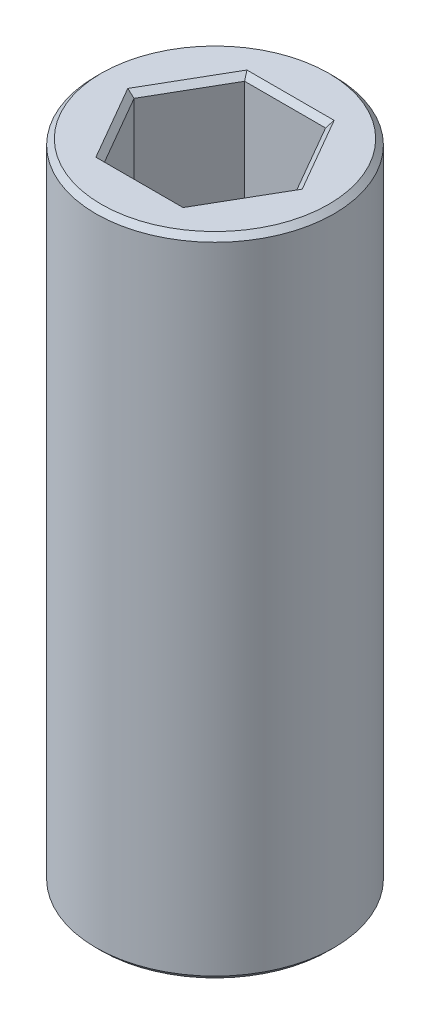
ISO-10303-21;
HEADER;
FILE_DESCRIPTION(('STEP AP214'),'2;1');
FILE_NAME('part.step','',(''),(''),'','','');
FILE_SCHEMA(('AUTOMOTIVE_DESIGN { 1 0 10303 214 1 1 1 1 }'));
ENDSEC;
DATA;
#1=APPLICATION_CONTEXT('core data for automotive mechanical design processes');
#2=APPLICATION_PROTOCOL_DEFINITION('international standard','automotive_design',2000,#1);
#3=PRODUCT_CONTEXT('',#1,'mechanical');
#4=PRODUCT('Part','Part','',(#3));
#5=PRODUCT_RELATED_PRODUCT_CATEGORY('part','',(#4));
#6=PRODUCT_DEFINITION_FORMATION('','',#4);
#7=PRODUCT_DEFINITION_CONTEXT('part definition',#1,'design');
#8=PRODUCT_DEFINITION('design','',#6,#7);
#9=PRODUCT_DEFINITION_SHAPE('','',#8);
#10=(LENGTH_UNIT() NAMED_UNIT(*) SI_UNIT(.MILLI.,.METRE.));
#11=(NAMED_UNIT(*) PLANE_ANGLE_UNIT() SI_UNIT($,.RADIAN.));
#12=(NAMED_UNIT(*) SI_UNIT($,.STERADIAN.) SOLID_ANGLE_UNIT());
#13=UNCERTAINTY_MEASURE_WITH_UNIT(LENGTH_MEASURE(1.E-05),#10,'distance_accuracy_value','');
#14=(GEOMETRIC_REPRESENTATION_CONTEXT(3) GLOBAL_UNCERTAINTY_ASSIGNED_CONTEXT((#13)) GLOBAL_UNIT_ASSIGNED_CONTEXT((#10,
#11,#12)) REPRESENTATION_CONTEXT('',''));
#15=CARTESIAN_POINT('',(0.,0.,0.));
#16=DIRECTION('',(0.,0.,1.));
#17=DIRECTION('',(1.,0.,0.));
#18=AXIS2_PLACEMENT_3D('',#15,#16,#17);
#19=CARTESIAN_POINT('',(0.,60.325,0.));
#20=DIRECTION('',(0.,1.,0.));
#21=DIRECTION('',(0.,0.,1.));
#22=AXIS2_PLACEMENT_3D('',#19,#20,#21);
#23=PLANE('',#22);
#24=CARTESIAN_POINT('',(0.,60.325,0.));
#25=DIRECTION('',(0.,1.,0.));
#26=DIRECTION('',(0.,0.,1.));
#27=AXIS2_PLACEMENT_3D('',#24,#25,#26);
#28=CIRCLE('',#27,10.6045);
#29=CARTESIAN_POINT('',(0.,60.325,10.6045));
#30=VERTEX_POINT('',#29);
#31=EDGE_CURVE('E13',#30,#30,#28,.T.);
#32=ORIENTED_EDGE('',*,*,#31,.T.);
#33=EDGE_LOOP('',(#32));
#34=FACE_BOUND('',#33,.T.);
#35=DIRECTION('',(-1.,0.,0.));
#36=VECTOR('',#35,1.);
#37=CARTESIAN_POINT('',(0.,60.325,7.0485));
#38=LINE('',#37,#36);
#39=CARTESIAN_POINT('',(4.06945337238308,60.325,7.0485));
#40=VERTEX_POINT('',#39);
#41=CARTESIAN_POINT('',(-4.06945337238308,60.325,7.04850000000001));
#42=VERTEX_POINT('',#41);
#43=EDGE_CURVE('E70',#40,#42,#38,.T.);
#44=ORIENTED_EDGE('',*,*,#43,.T.);
#45=DIRECTION('',(-0.5,0.,-0.866025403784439));
#46=VECTOR('',#45,1.);
#47=CARTESIAN_POINT('',(-6.10418005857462,60.325,3.52425));
#48=LINE('',#47,#46);
#49=CARTESIAN_POINT('',(-8.13890674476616,60.325,0.));
#50=VERTEX_POINT('',#49);
#51=EDGE_CURVE('E62',#42,#50,#48,.T.);
#52=ORIENTED_EDGE('',*,*,#51,.T.);
#53=DIRECTION('',(0.499999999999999,0.,-0.866025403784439));
#54=VECTOR('',#53,1.);
#55=CARTESIAN_POINT('',(-6.10418005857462,60.325,-3.52425));
#56=LINE('',#55,#54);
#57=CARTESIAN_POINT('',(-4.06945337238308,60.325,-7.0485));
#58=VERTEX_POINT('',#57);
#59=EDGE_CURVE('E238',#50,#58,#56,.T.);
#60=ORIENTED_EDGE('',*,*,#59,.T.);
#61=DIRECTION('',(1.,0.,0.));
#62=VECTOR('',#61,1.);
#63=CARTESIAN_POINT('',(0.,60.325,-7.0485));
#64=LINE('',#63,#62);
#65=CARTESIAN_POINT('',(4.06945337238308,60.325,-7.0485));
#66=VERTEX_POINT('',#65);
#67=EDGE_CURVE('E241',#58,#66,#64,.T.);
#68=ORIENTED_EDGE('',*,*,#67,.T.);
#69=DIRECTION('',(0.5,0.,0.866025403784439));
#70=VECTOR('',#69,1.);
#71=CARTESIAN_POINT('',(6.10418005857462,60.325,-3.52425));
#72=LINE('',#71,#70);
#73=CARTESIAN_POINT('',(8.13890674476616,60.325,0.));
#74=VERTEX_POINT('',#73);
#75=EDGE_CURVE('E244',#66,#74,#72,.T.);
#76=ORIENTED_EDGE('',*,*,#75,.T.);
#77=DIRECTION('',(-0.499999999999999,0.,0.866025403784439));
#78=VECTOR('',#77,1.);
#79=CARTESIAN_POINT('',(6.10418005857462,60.325,3.52425));
#80=LINE('',#79,#78);
#81=EDGE_CURVE('E75',#74,#40,#80,.T.);
#82=ORIENTED_EDGE('',*,*,#81,.T.);
#83=EDGE_LOOP('',(#44,#52,#60,#68,#76,#82));
#84=FACE_BOUND('',#83,.T.);
#85=ADVANCED_FACE('F51',(#34,#84),#23,.T.);
#86=CARTESIAN_POINT('',(0.,0.,0.));
#87=DIRECTION('',(0.,1.,0.));
#88=DIRECTION('',(0.,0.,1.));
#89=AXIS2_PLACEMENT_3D('',#86,#87,#88);
#90=PLANE('',#89);
#91=DIRECTION('',(-1.,0.,0.));
#92=VECTOR('',#91,1.);
#93=CARTESIAN_POINT('',(-3.77615943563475,0.,-7.0485));
#94=LINE('',#93,#92);
#95=CARTESIAN_POINT('',(4.06945337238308,0.,-7.0485));
#96=VERTEX_POINT('',#95);
#97=CARTESIAN_POINT('',(-4.06945337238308,0.,-7.0485));
#98=VERTEX_POINT('',#97);
#99=EDGE_CURVE('E149',#96,#98,#94,.T.);
#100=ORIENTED_EDGE('',*,*,#99,.T.);
#101=DIRECTION('',(-0.499999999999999,0.,0.866025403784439));
#102=VECTOR('',#101,1.);
#103=CARTESIAN_POINT('',(-7.99225977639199,0.,-0.253999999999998));
#104=LINE('',#103,#102);
#105=CARTESIAN_POINT('',(-8.13890674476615,0.,0.));
#106=VERTEX_POINT('',#105);
#107=EDGE_CURVE('E190',#98,#106,#104,.T.);
#108=ORIENTED_EDGE('',*,*,#107,.T.);
#109=DIRECTION('',(0.5,0.,0.866025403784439));
#110=VECTOR('',#109,1.);
#111=CARTESIAN_POINT('',(-4.21610034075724,0.,6.7945));
#112=LINE('',#111,#110);
#113=CARTESIAN_POINT('',(-4.06945337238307,0.,7.0485));
#114=VERTEX_POINT('',#113);
#115=EDGE_CURVE('E187',#106,#114,#112,.T.);
#116=ORIENTED_EDGE('',*,*,#115,.T.);
#117=DIRECTION('',(1.,0.,0.));
#118=VECTOR('',#117,1.);
#119=CARTESIAN_POINT('',(3.77615943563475,0.,7.0485));
#120=LINE('',#119,#118);
#121=CARTESIAN_POINT('',(4.06945337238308,0.,7.0485));
#122=VERTEX_POINT('',#121);
#123=EDGE_CURVE('E184',#114,#122,#120,.T.);
#124=ORIENTED_EDGE('',*,*,#123,.T.);
#125=DIRECTION('',(0.499999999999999,0.,-0.866025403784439));
#126=VECTOR('',#125,1.);
#127=CARTESIAN_POINT('',(7.99225977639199,0.,0.253999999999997));
#128=LINE('',#127,#126);
#129=CARTESIAN_POINT('',(8.13890674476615,0.,0.));
#130=VERTEX_POINT('',#129);
#131=EDGE_CURVE('E152',#122,#130,#128,.T.);
#132=ORIENTED_EDGE('',*,*,#131,.T.);
#133=DIRECTION('',(-0.5,0.,-0.866025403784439));
#134=VECTOR('',#133,1.);
#135=CARTESIAN_POINT('',(4.21610034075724,0.,-6.7945));
#136=LINE('',#135,#134);
#137=EDGE_CURVE('E143',#130,#96,#136,.T.);
#138=ORIENTED_EDGE('',*,*,#137,.T.);
#139=EDGE_LOOP('',(#100,#108,#116,#124,#132,#138));
#140=FACE_BOUND('',#139,.T.);
#141=CARTESIAN_POINT('',(0.,0.,0.));
#142=DIRECTION('',(0.,1.,0.));
#143=DIRECTION('',(0.,0.,1.));
#144=AXIS2_PLACEMENT_3D('',#141,#142,#143);
#145=CIRCLE('',#144,10.6044999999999);
#146=CARTESIAN_POINT('',(0.,0.,10.6044999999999));
#147=VERTEX_POINT('',#146);
#148=EDGE_CURVE('E173',#147,#147,#145,.F.);
#149=ORIENTED_EDGE('',*,*,#148,.T.);
#150=EDGE_LOOP('',(#149));
#151=FACE_BOUND('',#150,.T.);
#152=ADVANCED_FACE('F145',(#140,#151),#90,.F.);
#153=CARTESIAN_POINT('',(0.,60.325,0.));
#154=DIRECTION('',(0.,-1.,0.));
#155=DIRECTION('',(0.,0.,-1.));
#156=AXIS2_PLACEMENT_3D('',#153,#154,#155);
#157=CYLINDRICAL_SURFACE('',#156,11.1125);
#158=CARTESIAN_POINT('',(0.,0.50800000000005,0.));
#159=DIRECTION('',(0.,1.,0.));
#160=DIRECTION('',(0.,0.,1.));
#161=AXIS2_PLACEMENT_3D('',#158,#159,#160);
#162=CIRCLE('',#161,11.1125);
#163=CARTESIAN_POINT('',(0.,0.50800000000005,-11.1125));
#164=VERTEX_POINT('',#163);
#165=EDGE_CURVE('E234',#164,#164,#162,.T.);
#166=CARTESIAN_POINT('',(0.,59.817,0.));
#167=DIRECTION('',(0.,1.,0.));
#168=DIRECTION('',(0.,0.,1.));
#169=AXIS2_PLACEMENT_3D('',#166,#167,#168);
#170=CIRCLE('',#169,11.1125);
#171=CARTESIAN_POINT('',(0.,59.817,-11.1125));
#172=VERTEX_POINT('',#171);
#173=EDGE_CURVE('E230',#172,#172,#170,.F.);
#174=CARTESIAN_POINT('',(0.,0.50800000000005,-11.1125));
#175=CARTESIAN_POINT('',(0.,1.12580208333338,-11.1125));
#176=CARTESIAN_POINT('',(0.,1.74360416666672,-11.1125));
#177=CARTESIAN_POINT('',(0.,2.97920833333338,-11.1125));
#178=CARTESIAN_POINT('',(0.,3.59701041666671,-11.1125));
#179=CARTESIAN_POINT('',(0.,4.83261458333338,-11.1125));
#180=CARTESIAN_POINT('',(0.,5.45041666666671,-11.1125));
#181=CARTESIAN_POINT('',(0.,6.68602083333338,-11.1125));
#182=CARTESIAN_POINT('',(0.,7.30382291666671,-11.1125));
#183=CARTESIAN_POINT('',(0.,8.53942708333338,-11.1125));
#184=CARTESIAN_POINT('',(0.,9.15722916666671,-11.1125));
#185=CARTESIAN_POINT('',(0.,10.3928333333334,-11.1125));
#186=CARTESIAN_POINT('',(0.,11.0106354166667,-11.1125));
#187=CARTESIAN_POINT('',(0.,12.2462395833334,-11.1125));
#188=CARTESIAN_POINT('',(0.,12.8640416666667,-11.1125));
#189=CARTESIAN_POINT('',(0.,14.0996458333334,-11.1125));
#190=CARTESIAN_POINT('',(0.,14.7174479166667,-11.1125));
#191=CARTESIAN_POINT('',(0.,15.9530520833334,-11.1125));
#192=CARTESIAN_POINT('',(0.,16.5708541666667,-11.1125));
#193=CARTESIAN_POINT('',(0.,17.8064583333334,-11.1125));
#194=CARTESIAN_POINT('',(0.,18.4242604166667,-11.1125));
#195=CARTESIAN_POINT('',(0.,19.6598645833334,-11.1125));
#196=CARTESIAN_POINT('',(0.,20.2776666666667,-11.1125));
#197=CARTESIAN_POINT('',(0.,21.5132708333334,-11.1125));
#198=CARTESIAN_POINT('',(0.,22.1310729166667,-11.1125));
#199=CARTESIAN_POINT('',(0.,23.3666770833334,-11.1125));
#200=CARTESIAN_POINT('',(0.,23.9844791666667,-11.1125));
#201=CARTESIAN_POINT('',(0.,25.2200833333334,-11.1125));
#202=CARTESIAN_POINT('',(0.,25.8378854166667,-11.1125));
#203=CARTESIAN_POINT('',(0.,27.0734895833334,-11.1125));
#204=CARTESIAN_POINT('',(0.,27.6912916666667,-11.1125));
#205=CARTESIAN_POINT('',(0.,28.9268958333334,-11.1125));
#206=CARTESIAN_POINT('',(0.,29.5446979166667,-11.1125));
#207=CARTESIAN_POINT('',(0.,30.7803020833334,-11.1125));
#208=CARTESIAN_POINT('',(0.,31.3981041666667,-11.1125));
#209=CARTESIAN_POINT('',(0.,32.6337083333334,-11.1125));
#210=CARTESIAN_POINT('',(0.,33.2515104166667,-11.1125));
#211=CARTESIAN_POINT('',(0.,34.4871145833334,-11.1125));
#212=CARTESIAN_POINT('',(0.,35.1049166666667,-11.1125));
#213=CARTESIAN_POINT('',(0.,36.3405208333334,-11.1125));
#214=CARTESIAN_POINT('',(0.,36.9583229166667,-11.1125));
#215=CARTESIAN_POINT('',(0.,38.1939270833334,-11.1125));
#216=CARTESIAN_POINT('',(0.,38.8117291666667,-11.1125));
#217=CARTESIAN_POINT('',(0.,40.0473333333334,-11.1125));
#218=CARTESIAN_POINT('',(0.,40.6651354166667,-11.1125));
#219=CARTESIAN_POINT('',(0.,41.9007395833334,-11.1125));
#220=CARTESIAN_POINT('',(0.,42.5185416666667,-11.1125));
#221=CARTESIAN_POINT('',(0.,43.7541458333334,-11.1125));
#222=CARTESIAN_POINT('',(0.,44.3719479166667,-11.1125));
#223=CARTESIAN_POINT('',(0.,45.6075520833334,-11.1125));
#224=CARTESIAN_POINT('',(0.,46.2253541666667,-11.1125));
#225=CARTESIAN_POINT('',(0.,47.4609583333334,-11.1125));
#226=CARTESIAN_POINT('',(0.,48.0787604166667,-11.1125));
#227=CARTESIAN_POINT('',(0.,49.3143645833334,-11.1125));
#228=CARTESIAN_POINT('',(0.,49.9321666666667,-11.1125));
#229=CARTESIAN_POINT('',(0.,51.1677708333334,-11.1125));
#230=CARTESIAN_POINT('',(0.,51.7855729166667,-11.1125));
#231=CARTESIAN_POINT('',(0.,53.0211770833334,-11.1125));
#232=CARTESIAN_POINT('',(0.,53.6389791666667,-11.1125));
#233=CARTESIAN_POINT('',(0.,54.8745833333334,-11.1125));
#234=CARTESIAN_POINT('',(0.,55.4923854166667,-11.1125));
#235=CARTESIAN_POINT('',(0.,56.7279895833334,-11.1125));
#236=CARTESIAN_POINT('',(0.,57.3457916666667,-11.1125));
#237=CARTESIAN_POINT('',(0.,58.5813958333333,-11.1125));
#238=CARTESIAN_POINT('',(0.,59.1991979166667,-11.1125));
#239=CARTESIAN_POINT('',(0.,59.817,-11.1125));
#240=B_SPLINE_CURVE_WITH_KNOTS('',3,(#174,#175,#176,#177,#178,#179,#180,#181,#182,#183,#184,
#185,#186,#187,#188,#189,#190,#191,#192,#193,#194,#195,#196,#197,#198,#199,#200,#201,#202,#203,
#204,#205,#206,#207,#208,#209,#210,#211,#212,#213,#214,#215,#216,#217,#218,#219,#220,#221,#222,
#223,#224,#225,#226,#227,#228,#229,#230,#231,#232,#233,#234,#235,#236,#237,#238,#239),
.UNSPECIFIED.,.F.,.F.,(4,2,2,2,2,2,2,2,2,2,2,2,2,2,2,2,2,2,2,2,2,2,2,2,2,2,2,2,2,2,2,2,4),(0.,
1.85340625,3.7068125,5.56021875,7.41362499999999,9.26703125,11.1204375,12.97384375,14.82725,
16.68065625,18.5340625,20.38746875,22.240875,24.09428125,25.9476875,27.80109375,29.6545,
31.50790625,33.3613125,35.21471875,37.068125,38.92153125,40.7749375,42.62834375,44.48175,
46.33515625,48.1885625,50.04196875,51.895375,53.74878125,55.6021875,57.45559375,59.309),.UNSPECIFIED.);
#241=EDGE_CURVE('BSEAM383',#164,#172,#240,.T.);
#242=ORIENTED_EDGE('',*,*,#165,.T.);
#243=ORIENTED_EDGE('',*,*,#173,.T.);
#244=ORIENTED_EDGE('',*,*,#241,.T.);
#245=ORIENTED_EDGE('',*,*,#241,.F.);
#246=EDGE_LOOP('',(#242,#244,#243,#245));
#247=FACE_BOUND('',#246,.T.);
#248=ADVANCED_FACE('F383',(#247),#157,.T.);
#249=CARTESIAN_POINT('',(3.77615943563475,60.325,6.5405));
#250=DIRECTION('',(-0.866025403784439,0.,-0.499999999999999));
#251=DIRECTION('',(-0.499999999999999,0.,0.866025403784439));
#252=AXIS2_PLACEMENT_3D('',#249,#250,#251);
#253=PLANE('',#252);
#254=DIRECTION('',(0.,-1.,0.));
#255=VECTOR('',#254,1.);
#256=CARTESIAN_POINT('',(7.55231887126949,60.325,0.));
#257=LINE('',#256,#255);
#258=CARTESIAN_POINT('',(7.55231887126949,59.817,0.));
#259=VERTEX_POINT('',#258);
#260=CARTESIAN_POINT('',(7.55231887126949,0.508000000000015,0.));
#261=VERTEX_POINT('',#260);
#262=EDGE_CURVE('E178',#259,#261,#257,.T.);
#263=ORIENTED_EDGE('',*,*,#262,.T.);
#264=DIRECTION('',(-0.499999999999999,0.,0.866025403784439));
#265=VECTOR('',#264,1.);
#266=CARTESIAN_POINT('',(3.77615943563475,0.508000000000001,6.5405));
#267=LINE('',#266,#265);
#268=CARTESIAN_POINT('',(3.77615943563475,0.508000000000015,6.5405));
#269=VERTEX_POINT('',#268);
#270=EDGE_CURVE('E216',#261,#269,#267,.T.);
#271=ORIENTED_EDGE('',*,*,#270,.T.);
#272=DIRECTION('',(0.,-1.,0.));
#273=VECTOR('',#272,1.);
#274=CARTESIAN_POINT('',(3.77615943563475,60.325,6.5405));
#275=LINE('',#274,#273);
#276=CARTESIAN_POINT('',(3.77615943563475,59.817,6.5405));
#277=VERTEX_POINT('',#276);
#278=EDGE_CURVE('E267',#277,#269,#275,.T.);
#279=ORIENTED_EDGE('',*,*,#278,.F.);
#280=DIRECTION('',(0.499999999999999,0.,-0.866025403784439));
#281=VECTOR('',#280,1.);
#282=CARTESIAN_POINT('',(3.77615943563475,59.817,6.5405));
#283=LINE('',#282,#281);
#284=EDGE_CURVE('E213',#277,#259,#283,.T.);
#285=ORIENTED_EDGE('',*,*,#284,.T.);
#286=EDGE_LOOP('',(#263,#271,#279,#285));
#287=FACE_BOUND('',#286,.T.);
#288=ADVANCED_FACE('F339',(#287),#253,.T.);
#289=CARTESIAN_POINT('',(7.55231887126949,60.325,0.));
#290=DIRECTION('',(-0.866025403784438,0.,0.5));
#291=DIRECTION('',(0.5,0.,0.866025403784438));
#292=AXIS2_PLACEMENT_3D('',#289,#290,#291);
#293=PLANE('',#292);
#294=DIRECTION('',(0.,-1.,0.));
#295=VECTOR('',#294,1.);
#296=CARTESIAN_POINT('',(3.77615943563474,60.325,-6.5405));
#297=LINE('',#296,#295);
#298=CARTESIAN_POINT('',(3.77615943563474,59.817,-6.5405));
#299=VERTEX_POINT('',#298);
#300=CARTESIAN_POINT('',(3.77615943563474,0.508000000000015,-6.5405));
#301=VERTEX_POINT('',#300);
#302=EDGE_CURVE('E326',#299,#301,#297,.T.);
#303=ORIENTED_EDGE('',*,*,#302,.T.);
#304=DIRECTION('',(0.5,0.,0.866025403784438));
#305=VECTOR('',#304,1.);
#306=CARTESIAN_POINT('',(7.55231887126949,0.508000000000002,0.));
#307=LINE('',#306,#305);
#308=EDGE_CURVE('E162',#301,#261,#307,.T.);
#309=ORIENTED_EDGE('',*,*,#308,.T.);
#310=ORIENTED_EDGE('',*,*,#262,.F.);
#311=DIRECTION('',(-0.5,0.,-0.866025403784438));
#312=VECTOR('',#311,1.);
#313=CARTESIAN_POINT('',(7.55231887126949,59.817,0.));
#314=LINE('',#313,#312);
#315=EDGE_CURVE('E219',#259,#299,#314,.T.);
#316=ORIENTED_EDGE('',*,*,#315,.T.);
#317=EDGE_LOOP('',(#303,#309,#310,#316));
#318=FACE_BOUND('',#317,.T.);
#319=ADVANCED_FACE('F584',(#318),#293,.T.);
#320=CARTESIAN_POINT('',(3.77615943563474,60.325,-6.5405));
#321=DIRECTION('',(0.,0.,1.));
#322=DIRECTION('',(1.,0.,0.));
#323=AXIS2_PLACEMENT_3D('',#320,#321,#322);
#324=PLANE('',#323);
#325=DIRECTION('',(0.,-1.,0.));
#326=VECTOR('',#325,1.);
#327=CARTESIAN_POINT('',(-3.77615943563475,60.325,-6.5405));
#328=LINE('',#327,#326);
#329=CARTESIAN_POINT('',(-3.77615943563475,59.817,-6.5405));
#330=VERTEX_POINT('',#329);
#331=CARTESIAN_POINT('',(-3.77615943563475,0.508000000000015,-6.5405));
#332=VERTEX_POINT('',#331);
#333=EDGE_CURVE('E314',#330,#332,#328,.T.);
#334=ORIENTED_EDGE('',*,*,#333,.T.);
#335=DIRECTION('',(1.,0.,0.));
#336=VECTOR('',#335,1.);
#337=CARTESIAN_POINT('',(3.77615943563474,0.508000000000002,-6.5405));
#338=LINE('',#337,#336);
#339=EDGE_CURVE('E227',#332,#301,#338,.T.);
#340=ORIENTED_EDGE('',*,*,#339,.T.);
#341=ORIENTED_EDGE('',*,*,#302,.F.);
#342=DIRECTION('',(-1.,0.,0.));
#343=VECTOR('',#342,1.);
#344=CARTESIAN_POINT('',(3.77615943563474,59.817,-6.5405));
#345=LINE('',#344,#343);
#346=EDGE_CURVE('E224',#299,#330,#345,.T.);
#347=ORIENTED_EDGE('',*,*,#346,.T.);
#348=EDGE_LOOP('',(#334,#340,#341,#347));
#349=FACE_BOUND('',#348,.T.);
#350=ADVANCED_FACE('F575',(#349),#324,.T.);
#351=CARTESIAN_POINT('',(-3.77615943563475,60.325,-6.5405));
#352=DIRECTION('',(0.866025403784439,0.,0.499999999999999));
#353=DIRECTION('',(0.499999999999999,0.,-0.866025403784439));
#354=AXIS2_PLACEMENT_3D('',#351,#352,#353);
#355=PLANE('',#354);
#356=DIRECTION('',(0.,-1.,0.));
#357=VECTOR('',#356,1.);
#358=CARTESIAN_POINT('',(-7.55231887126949,60.325,0.));
#359=LINE('',#358,#357);
#360=CARTESIAN_POINT('',(-7.55231887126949,59.817,0.));
#361=VERTEX_POINT('',#360);
#362=CARTESIAN_POINT('',(-7.55231887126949,0.508000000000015,0.));
#363=VERTEX_POINT('',#362);
#364=EDGE_CURVE('E311',#361,#363,#359,.T.);
#365=ORIENTED_EDGE('',*,*,#364,.T.);
#366=DIRECTION('',(0.499999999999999,0.,-0.866025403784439));
#367=VECTOR('',#366,1.);
#368=CARTESIAN_POINT('',(-3.77615943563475,0.508000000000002,-6.5405));
#369=LINE('',#368,#367);
#370=EDGE_CURVE('E196',#363,#332,#369,.T.);
#371=ORIENTED_EDGE('',*,*,#370,.T.);
#372=ORIENTED_EDGE('',*,*,#333,.F.);
#373=DIRECTION('',(-0.499999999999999,0.,0.866025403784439));
#374=VECTOR('',#373,1.);
#375=CARTESIAN_POINT('',(-3.77615943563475,59.817,-6.5405));
#376=LINE('',#375,#374);
#377=EDGE_CURVE('E193',#330,#361,#376,.T.);
#378=ORIENTED_EDGE('',*,*,#377,.T.);
#379=EDGE_LOOP('',(#365,#371,#372,#378));
#380=FACE_BOUND('',#379,.T.);
#381=ADVANCED_FACE('F310',(#380),#355,.T.);
#382=CARTESIAN_POINT('',(-7.55231887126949,60.325,0.));
#383=DIRECTION('',(0.866025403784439,0.,-0.5));
#384=DIRECTION('',(-0.5,0.,-0.866025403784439));
#385=AXIS2_PLACEMENT_3D('',#382,#383,#384);
#386=PLANE('',#385);
#387=DIRECTION('',(0.,-1.,0.));
#388=VECTOR('',#387,1.);
#389=CARTESIAN_POINT('',(-3.77615943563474,60.325,6.5405));
#390=LINE('',#389,#388);
#391=CARTESIAN_POINT('',(-3.77615943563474,59.817,6.5405));
#392=VERTEX_POINT('',#391);
#393=CARTESIAN_POINT('',(-3.77615943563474,0.508000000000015,6.5405));
#394=VERTEX_POINT('',#393);
#395=EDGE_CURVE('E321',#392,#394,#390,.T.);
#396=ORIENTED_EDGE('',*,*,#395,.T.);
#397=DIRECTION('',(-0.5,0.,-0.866025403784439));
#398=VECTOR('',#397,1.);
#399=CARTESIAN_POINT('',(-7.55231887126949,0.508000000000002,0.));
#400=LINE('',#399,#398);
#401=EDGE_CURVE('E204',#394,#363,#400,.T.);
#402=ORIENTED_EDGE('',*,*,#401,.T.);
#403=ORIENTED_EDGE('',*,*,#364,.F.);
#404=DIRECTION('',(0.5,0.,0.866025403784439));
#405=VECTOR('',#404,1.);
#406=CARTESIAN_POINT('',(-7.55231887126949,59.817,0.));
#407=LINE('',#406,#405);
#408=EDGE_CURVE('E200',#361,#392,#407,.T.);
#409=ORIENTED_EDGE('',*,*,#408,.T.);
#410=EDGE_LOOP('',(#396,#402,#403,#409));
#411=FACE_BOUND('',#410,.T.);
#412=ADVANCED_FACE('F317',(#411),#386,.T.);
#413=CARTESIAN_POINT('',(-3.77615943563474,60.325,6.5405));
#414=DIRECTION('',(0.,0.,-1.));
#415=DIRECTION('',(-1.,0.,0.));
#416=AXIS2_PLACEMENT_3D('',#413,#414,#415);
#417=PLANE('',#416);
#418=ORIENTED_EDGE('',*,*,#278,.T.);
#419=DIRECTION('',(-1.,0.,0.));
#420=VECTOR('',#419,1.);
#421=CARTESIAN_POINT('',(-3.77615943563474,0.508000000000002,6.5405));
#422=LINE('',#421,#420);
#423=EDGE_CURVE('E210',#269,#394,#422,.T.);
#424=ORIENTED_EDGE('',*,*,#423,.T.);
#425=ORIENTED_EDGE('',*,*,#395,.F.);
#426=DIRECTION('',(1.,0.,0.));
#427=VECTOR('',#426,1.);
#428=CARTESIAN_POINT('',(-3.77615943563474,59.817,6.5405));
#429=LINE('',#428,#427);
#430=EDGE_CURVE('E207',#392,#277,#429,.T.);
#431=ORIENTED_EDGE('',*,*,#430,.T.);
#432=EDGE_LOOP('',(#418,#424,#425,#431));
#433=FACE_BOUND('',#432,.T.);
#434=ADVANCED_FACE('F352',(#433),#417,.T.);
#435=CARTESIAN_POINT('',(6.10418005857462,0.,3.52425));
#436=DIRECTION('',(-0.612372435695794,-0.707106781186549,-0.353553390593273));
#437=DIRECTION('',(-0.499999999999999,0.,0.866025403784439));
#438=AXIS2_PLACEMENT_3D('',#435,#436,#437);
#439=PLANE('',#438);
#440=DIRECTION('',(-0.37796447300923,0.654653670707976,-0.654653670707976));
#441=VECTOR('',#440,1.);
#442=CARTESIAN_POINT('',(3.48810289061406,1.00692857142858,6.04157142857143));
#443=LINE('',#442,#441);
#444=EDGE_CURVE('E166',#269,#122,#443,.F.);
#445=ORIENTED_EDGE('',*,*,#444,.F.);
#446=ORIENTED_EDGE('',*,*,#270,.F.);
#447=DIRECTION('',(-0.755928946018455,0.654653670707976,0.));
#448=VECTOR('',#447,1.);
#449=CARTESIAN_POINT('',(6.97620578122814,1.00692857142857,0.));
#450=LINE('',#449,#448);
#451=EDGE_CURVE('E264',#130,#261,#450,.T.);
#452=ORIENTED_EDGE('',*,*,#451,.F.);
#453=ORIENTED_EDGE('',*,*,#131,.F.);
#454=EDGE_LOOP('',(#445,#446,#452,#453));
#455=FACE_BOUND('',#454,.T.);
#456=ADVANCED_FACE('F345',(#455),#439,.T.);
#457=CARTESIAN_POINT('',(6.10418005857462,0.,-3.52425));
#458=DIRECTION('',(-0.612372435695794,-0.707106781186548,0.353553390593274));
#459=DIRECTION('',(0.5,0.,0.866025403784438));
#460=AXIS2_PLACEMENT_3D('',#457,#458,#459);
#461=PLANE('',#460);
#462=ORIENTED_EDGE('',*,*,#451,.T.);
#463=ORIENTED_EDGE('',*,*,#308,.F.);
#464=DIRECTION('',(-0.377964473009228,0.654653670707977,0.654653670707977));
#465=VECTOR('',#464,1.);
#466=CARTESIAN_POINT('',(3.48810289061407,1.00692857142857,-6.04157142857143));
#467=LINE('',#466,#465);
#468=EDGE_CURVE('E160',#96,#301,#467,.T.);
#469=ORIENTED_EDGE('',*,*,#468,.F.);
#470=ORIENTED_EDGE('',*,*,#137,.F.);
#471=EDGE_LOOP('',(#462,#463,#469,#470));
#472=FACE_BOUND('',#471,.T.);
#473=ADVANCED_FACE('F161',(#472),#461,.T.);
#474=CARTESIAN_POINT('',(0.,0.,7.0485));
#475=DIRECTION('',(0.,-0.707106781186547,-0.707106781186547));
#476=DIRECTION('',(-1.,0.,0.));
#477=AXIS2_PLACEMENT_3D('',#474,#475,#476);
#478=PLANE('',#477);
#479=ORIENTED_EDGE('',*,*,#444,.T.);
#480=ORIENTED_EDGE('',*,*,#123,.F.);
#481=DIRECTION('',(0.377964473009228,0.654653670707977,-0.654653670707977));
#482=VECTOR('',#481,1.);
#483=CARTESIAN_POINT('',(-3.48810289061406,1.00692857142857,6.04157142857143));
#484=LINE('',#483,#482);
#485=EDGE_CURVE('E167',#394,#114,#484,.F.);
#486=ORIENTED_EDGE('',*,*,#485,.F.);
#487=ORIENTED_EDGE('',*,*,#423,.F.);
#488=EDGE_LOOP('',(#479,#480,#486,#487));
#489=FACE_BOUND('',#488,.T.);
#490=ADVANCED_FACE('F350',(#489),#478,.T.);
#491=CARTESIAN_POINT('',(0.,0.,-7.0485));
#492=DIRECTION('',(0.,-0.707106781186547,0.707106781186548));
#493=DIRECTION('',(1.,0.,0.));
#494=AXIS2_PLACEMENT_3D('',#491,#492,#493);
#495=PLANE('',#494);
#496=ORIENTED_EDGE('',*,*,#468,.T.);
#497=ORIENTED_EDGE('',*,*,#339,.F.);
#498=DIRECTION('',(-0.377964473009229,-0.654653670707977,-0.654653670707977));
#499=VECTOR('',#498,1.);
#500=CARTESIAN_POINT('',(-3.48810289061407,1.00692857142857,-6.04157142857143));
#501=LINE('',#500,#499);
#502=EDGE_CURVE('E170',#98,#332,#501,.F.);
#503=ORIENTED_EDGE('',*,*,#502,.F.);
#504=ORIENTED_EDGE('',*,*,#99,.F.);
#505=EDGE_LOOP('',(#496,#497,#503,#504));
#506=FACE_BOUND('',#505,.T.);
#507=ADVANCED_FACE('F169',(#506),#495,.T.);
#508=CARTESIAN_POINT('',(-6.10418005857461,0.,3.52425));
#509=DIRECTION('',(0.612372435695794,-0.707106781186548,-0.353553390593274));
#510=DIRECTION('',(-0.5,0.,-0.866025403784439));
#511=AXIS2_PLACEMENT_3D('',#508,#509,#510);
#512=PLANE('',#511);
#513=ORIENTED_EDGE('',*,*,#485,.T.);
#514=ORIENTED_EDGE('',*,*,#115,.F.);
#515=DIRECTION('',(0.755928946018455,0.654653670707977,0.));
#516=VECTOR('',#515,1.);
#517=CARTESIAN_POINT('',(-6.97620578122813,1.00692857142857,0.));
#518=LINE('',#517,#516);
#519=EDGE_CURVE('E253',#363,#106,#518,.F.);
#520=ORIENTED_EDGE('',*,*,#519,.F.);
#521=ORIENTED_EDGE('',*,*,#401,.F.);
#522=EDGE_LOOP('',(#513,#514,#520,#521));
#523=FACE_BOUND('',#522,.T.);
#524=ADVANCED_FACE('F400',(#523),#512,.T.);
#525=CARTESIAN_POINT('',(-6.10418005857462,0.,-3.52425));
#526=DIRECTION('',(0.612372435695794,-0.707106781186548,0.353553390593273));
#527=DIRECTION('',(0.499999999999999,0.,-0.866025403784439));
#528=AXIS2_PLACEMENT_3D('',#525,#526,#527);
#529=PLANE('',#528);
#530=ORIENTED_EDGE('',*,*,#502,.T.);
#531=ORIENTED_EDGE('',*,*,#370,.F.);
#532=ORIENTED_EDGE('',*,*,#519,.T.);
#533=ORIENTED_EDGE('',*,*,#107,.F.);
#534=EDGE_LOOP('',(#530,#531,#532,#533));
#535=FACE_BOUND('',#534,.T.);
#536=ADVANCED_FACE('F392',(#535),#529,.T.);
#537=CARTESIAN_POINT('',(0.,0.50800000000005,0.));
#538=DIRECTION('',(0.,1.,0.));
#539=DIRECTION('',(0.,0.,1.));
#540=AXIS2_PLACEMENT_3D('',#537,#538,#539);
#541=CONICAL_SURFACE('',#540,11.1125,0.785398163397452);
#542=ORIENTED_EDGE('',*,*,#148,.F.);
#543=EDGE_LOOP('',(#542));
#544=FACE_BOUND('',#543,.T.);
#545=ORIENTED_EDGE('',*,*,#165,.F.);
#546=EDGE_LOOP('',(#545));
#547=FACE_BOUND('',#546,.T.);
#548=ADVANCED_FACE('F399',(#544,#547),#541,.T.);
#549=CARTESIAN_POINT('',(0.,60.325,0.));
#550=DIRECTION('',(0.,-1.,0.));
#551=DIRECTION('',(0.,0.,-1.));
#552=AXIS2_PLACEMENT_3D('',#549,#550,#551);
#553=CONICAL_SURFACE('',#552,10.6045,0.785398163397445);
#554=ORIENTED_EDGE('',*,*,#173,.F.);
#555=EDGE_LOOP('',(#554));
#556=FACE_BOUND('',#555,.T.);
#557=ORIENTED_EDGE('',*,*,#31,.F.);
#558=EDGE_LOOP('',(#557));
#559=FACE_BOUND('',#558,.T.);
#560=ADVANCED_FACE('F431',(#556,#559),#553,.T.);
#561=CARTESIAN_POINT('',(7.55231887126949,59.817,0.));
#562=DIRECTION('',(0.612372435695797,-0.707106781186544,-0.353553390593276));
#563=DIRECTION('',(-0.5,0.,-0.866025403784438));
#564=AXIS2_PLACEMENT_3D('',#561,#562,#563);
#565=PLANE('',#564);
#566=DIRECTION('',(0.755928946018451,0.654653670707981,0.));
#567=VECTOR('',#566,1.);
#568=CARTESIAN_POINT('',(5.39451347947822,57.9482857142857,0.));
#569=LINE('',#568,#567);
#570=EDGE_CURVE('E281',#74,#259,#569,.F.);
#571=ORIENTED_EDGE('',*,*,#570,.F.);
#572=ORIENTED_EDGE('',*,*,#75,.F.);
#573=DIRECTION('',(0.377964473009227,0.654653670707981,-0.654653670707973));
#574=VECTOR('',#573,1.);
#575=CARTESIAN_POINT('',(2.69725673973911,57.9482857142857,-4.67178571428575));
#576=LINE('',#575,#574);
#577=EDGE_CURVE('E56',#299,#66,#576,.T.);
#578=ORIENTED_EDGE('',*,*,#577,.F.);
#579=ORIENTED_EDGE('',*,*,#315,.F.);
#580=EDGE_LOOP('',(#571,#572,#578,#579));
#581=FACE_BOUND('',#580,.T.);
#582=ADVANCED_FACE('F54',(#581),#565,.F.);
#583=CARTESIAN_POINT('',(3.77615943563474,59.817,-6.5405));
#584=DIRECTION('',(0.,-0.707106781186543,-0.707106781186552));
#585=DIRECTION('',(-1.,0.,0.));
#586=AXIS2_PLACEMENT_3D('',#583,#584,#585);
#587=PLANE('',#586);
#588=ORIENTED_EDGE('',*,*,#577,.T.);
#589=ORIENTED_EDGE('',*,*,#67,.F.);
#590=DIRECTION('',(-0.377964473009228,0.654653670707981,-0.654653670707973));
#591=VECTOR('',#590,1.);
#592=CARTESIAN_POINT('',(-2.6972567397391,57.9482857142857,-4.67178571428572));
#593=LINE('',#592,#591);
#594=EDGE_CURVE('E278',#330,#58,#593,.T.);
#595=ORIENTED_EDGE('',*,*,#594,.F.);
#596=ORIENTED_EDGE('',*,*,#346,.F.);
#597=EDGE_LOOP('',(#588,#589,#595,#596));
#598=FACE_BOUND('',#597,.T.);
#599=ADVANCED_FACE('F295',(#598),#587,.F.);
#600=CARTESIAN_POINT('',(3.77615943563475,59.817,6.5405));
#601=DIRECTION('',(0.612372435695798,-0.707106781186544,0.353553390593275));
#602=DIRECTION('',(0.499999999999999,0.,-0.866025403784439));
#603=AXIS2_PLACEMENT_3D('',#600,#601,#602);
#604=PLANE('',#603);
#605=ORIENTED_EDGE('',*,*,#570,.T.);
#606=ORIENTED_EDGE('',*,*,#284,.F.);
#607=DIRECTION('',(0.377964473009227,0.654653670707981,0.654653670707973));
#608=VECTOR('',#607,1.);
#609=CARTESIAN_POINT('',(2.69725673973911,57.9482857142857,4.67178571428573));
#610=LINE('',#609,#608);
#611=EDGE_CURVE('E274',#40,#277,#610,.F.);
#612=ORIENTED_EDGE('',*,*,#611,.F.);
#613=ORIENTED_EDGE('',*,*,#81,.F.);
#614=EDGE_LOOP('',(#605,#606,#612,#613));
#615=FACE_BOUND('',#614,.T.);
#616=ADVANCED_FACE('F363',(#615),#604,.F.);
#617=CARTESIAN_POINT('',(-3.77615943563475,59.817,-6.5405));
#618=DIRECTION('',(-0.612372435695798,-0.707106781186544,-0.353553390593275));
#619=DIRECTION('',(-0.499999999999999,0.,0.866025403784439));
#620=AXIS2_PLACEMENT_3D('',#617,#618,#619);
#621=PLANE('',#620);
#622=ORIENTED_EDGE('',*,*,#594,.T.);
#623=ORIENTED_EDGE('',*,*,#59,.F.);
#624=DIRECTION('',(0.755928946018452,-0.654653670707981,0.));
#625=VECTOR('',#624,1.);
#626=CARTESIAN_POINT('',(-7.55231887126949,59.817,0.));
#627=LINE('',#626,#625);
#628=EDGE_CURVE('E271',#361,#50,#627,.F.);
#629=ORIENTED_EDGE('',*,*,#628,.F.);
#630=ORIENTED_EDGE('',*,*,#377,.F.);
#631=EDGE_LOOP('',(#622,#623,#629,#630));
#632=FACE_BOUND('',#631,.T.);
#633=ADVANCED_FACE('F303',(#632),#621,.F.);
#634=CARTESIAN_POINT('',(-3.77615943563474,59.817,6.5405));
#635=DIRECTION('',(0.,-0.707106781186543,0.707106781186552));
#636=DIRECTION('',(1.,0.,0.));
#637=AXIS2_PLACEMENT_3D('',#634,#635,#636);
#638=PLANE('',#637);
#639=ORIENTED_EDGE('',*,*,#611,.T.);
#640=ORIENTED_EDGE('',*,*,#430,.F.);
#641=DIRECTION('',(-0.377964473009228,0.654653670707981,0.654653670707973));
#642=VECTOR('',#641,1.);
#643=CARTESIAN_POINT('',(-2.69725673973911,57.9482857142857,4.67178571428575));
#644=LINE('',#643,#642);
#645=EDGE_CURVE('E268',#42,#392,#644,.F.);
#646=ORIENTED_EDGE('',*,*,#645,.F.);
#647=ORIENTED_EDGE('',*,*,#43,.F.);
#648=EDGE_LOOP('',(#639,#640,#646,#647));
#649=FACE_BOUND('',#648,.T.);
#650=ADVANCED_FACE('F365',(#649),#638,.F.);
#651=CARTESIAN_POINT('',(-7.55231887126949,59.817,0.));
#652=DIRECTION('',(-0.612372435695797,-0.707106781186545,0.353553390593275));
#653=DIRECTION('',(0.5,0.,0.866025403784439));
#654=AXIS2_PLACEMENT_3D('',#651,#652,#653);
#655=PLANE('',#654);
#656=ORIENTED_EDGE('',*,*,#628,.T.);
#657=ORIENTED_EDGE('',*,*,#51,.F.);
#658=ORIENTED_EDGE('',*,*,#645,.T.);
#659=ORIENTED_EDGE('',*,*,#408,.F.);
#660=EDGE_LOOP('',(#656,#657,#658,#659));
#661=FACE_BOUND('',#660,.T.);
#662=ADVANCED_FACE('F368',(#661),#655,.F.);
#663=CLOSED_SHELL('',(#85,#152,#248,#288,#319,#350,#381,#412,#434,#456,#473,#490,#507,#524,#536,
#548,#560,#582,#599,#616,#633,#650,#662));
#664=MANIFOLD_SOLID_BREP('B2',#663);
#665=ADVANCED_BREP_SHAPE_REPRESENTATION('',(#18,#664),#14);
#666=SHAPE_DEFINITION_REPRESENTATION(#9,#665);
ENDSEC;
END-ISO-10303-21;
